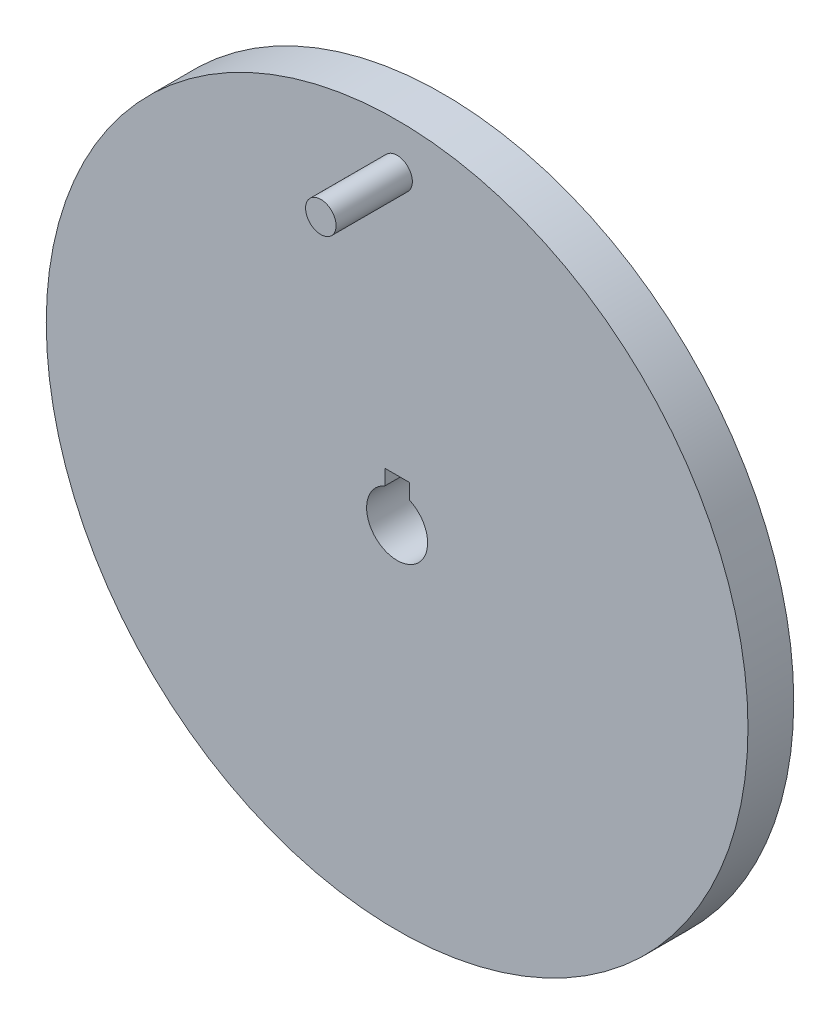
from build123d import *

# Parameters (mm, degrees)
SKETCH1_R          = 115
EXTRUDE1_DEPTH     = 15
SKETCH2_R          = 5
EXTRUDE2_DEPTH     = 25
CUT_EXTRUDE1_DEPTH = 165.544826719


with BuildPart() as part:
    # Sketch1 → Extrude1 (new body)
    with BuildSketch(Plane.XY):
        Circle(SKETCH1_R)
    extrude(amount=-EXTRUDE1_DEPTH)

    # Sketch2 → Extrude2 (add)
    with BuildSketch(Plane.XY):
        with Locations((0, 100)):
            Circle(SKETCH2_R)
    extrude(amount=EXTRUDE2_DEPTH)

    # Sketch3 → Cut-Extrude1 (cut, through all)
    with BuildSketch(Plane.XY):
        with BuildLine():
            Line((4, 9.16515139), (4, 14.16515139))
            Line((4, 14.16515139), (-4, 14.16515139))
            Line((-4, 14.16515139), (-4, 9.16515139))
            ThreePointArc((-4, 9.16515139), (0, -10), (4, 9.16515139))
        make_face()
    extrude(amount=-CUT_EXTRUDE1_DEPTH, mode=Mode.SUBTRACT)


solid = part.part
